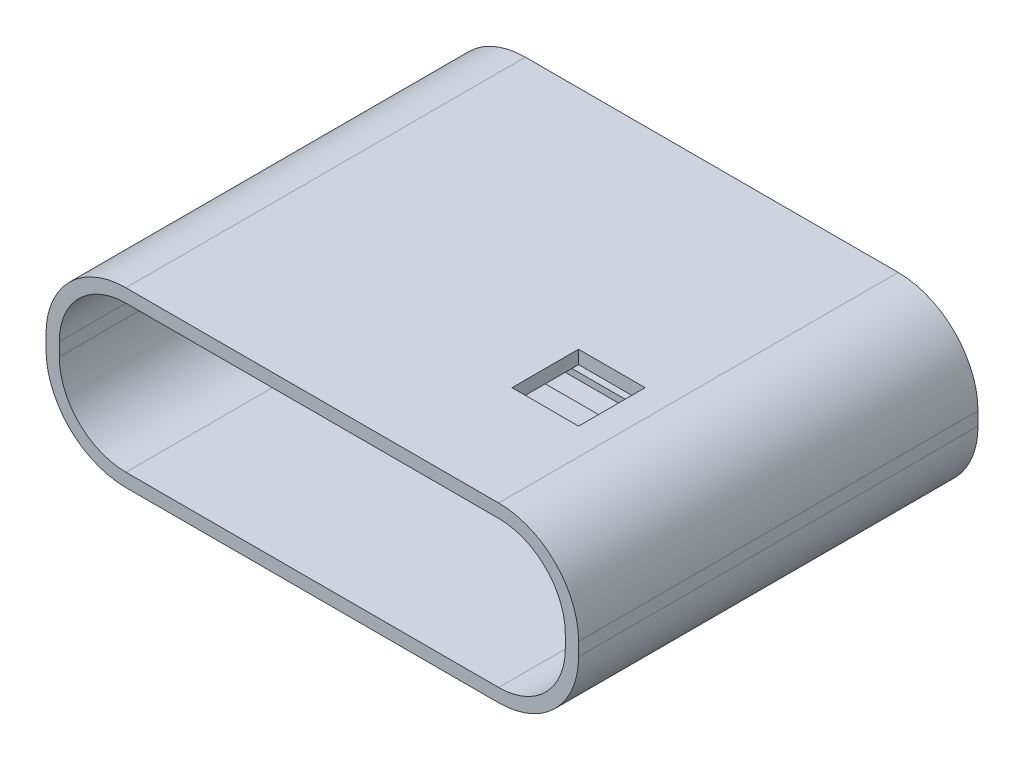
ISO-10303-21;
HEADER;
FILE_DESCRIPTION(('STEP AP214'),'2;1');
FILE_NAME('part.step','',(''),(''),'','','');
FILE_SCHEMA(('AUTOMOTIVE_DESIGN { 1 0 10303 214 1 1 1 1 }'));
ENDSEC;
DATA;
#1=APPLICATION_CONTEXT('core data for automotive mechanical design processes');
#2=APPLICATION_PROTOCOL_DEFINITION('international standard','automotive_design',2000,#1);
#3=PRODUCT_CONTEXT('',#1,'mechanical');
#4=PRODUCT('Part','Part','',(#3));
#5=PRODUCT_RELATED_PRODUCT_CATEGORY('part','',(#4));
#6=PRODUCT_DEFINITION_FORMATION('','',#4);
#7=PRODUCT_DEFINITION_CONTEXT('part definition',#1,'design');
#8=PRODUCT_DEFINITION('design','',#6,#7);
#9=PRODUCT_DEFINITION_SHAPE('','',#8);
#10=(LENGTH_UNIT() NAMED_UNIT(*) SI_UNIT(.MILLI.,.METRE.));
#11=(NAMED_UNIT(*) PLANE_ANGLE_UNIT() SI_UNIT($,.RADIAN.));
#12=(NAMED_UNIT(*) SI_UNIT($,.STERADIAN.) SOLID_ANGLE_UNIT());
#13=UNCERTAINTY_MEASURE_WITH_UNIT(LENGTH_MEASURE(1.E-05),#10,'distance_accuracy_value','');
#14=(GEOMETRIC_REPRESENTATION_CONTEXT(3) GLOBAL_UNCERTAINTY_ASSIGNED_CONTEXT((#13)) GLOBAL_UNIT_ASSIGNED_CONTEXT((#10,
#11,#12)) REPRESENTATION_CONTEXT('',''));
#15=CARTESIAN_POINT('',(0.,0.,0.));
#16=DIRECTION('',(0.,0.,1.));
#17=DIRECTION('',(1.,0.,0.));
#18=AXIS2_PLACEMENT_3D('',#15,#16,#17);
#19=CARTESIAN_POINT('',(-45.1180388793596,5.,30.));
#20=DIRECTION('',(0.,0.,-1.));
#21=DIRECTION('',(-1.,0.,0.));
#22=AXIS2_PLACEMENT_3D('',#19,#20,#21);
#23=PLANE('',#22);
#24=CARTESIAN_POINT('',(-45.1180388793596,5.,30.));
#25=DIRECTION('',(0.,0.,-1.));
#26=DIRECTION('',(-1.,0.,0.));
#27=AXIS2_PLACEMENT_3D('',#24,#25,#26);
#28=CIRCLE('',#27,6.);
#29=CARTESIAN_POINT('',(-51.1180388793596,4.99999999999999,30.));
#30=VERTEX_POINT('',#29);
#31=CARTESIAN_POINT('',(-45.1180388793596,-1.,30.));
#32=VERTEX_POINT('',#31);
#33=EDGE_CURVE('E370',#30,#32,#28,.F.);
#34=ORIENTED_EDGE('',*,*,#33,.T.);
#35=DIRECTION('',(1.,0.,0.));
#36=VECTOR('',#35,1.);
#37=CARTESIAN_POINT('',(-45.1180388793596,-1.,30.));
#38=LINE('',#37,#36);
#39=CARTESIAN_POINT('',(-17.1180388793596,-1.,30.));
#40=VERTEX_POINT('',#39);
#41=EDGE_CURVE('E373',#32,#40,#38,.T.);
#42=ORIENTED_EDGE('',*,*,#41,.T.);
#43=CARTESIAN_POINT('',(-17.1180388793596,5.,30.));
#44=DIRECTION('',(0.,0.,-1.));
#45=DIRECTION('',(-1.,0.,0.));
#46=AXIS2_PLACEMENT_3D('',#43,#44,#45);
#47=CIRCLE('',#46,6.);
#48=CARTESIAN_POINT('',(-11.1180388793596,5.,30.));
#49=VERTEX_POINT('',#48);
#50=EDGE_CURVE('E376',#40,#49,#47,.F.);
#51=ORIENTED_EDGE('',*,*,#50,.T.);
#52=DIRECTION('',(0.,1.,0.));
#53=VECTOR('',#52,1.);
#54=CARTESIAN_POINT('',(-11.1180388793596,5.,30.));
#55=LINE('',#54,#53);
#56=CARTESIAN_POINT('',(-11.1180388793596,6.,30.));
#57=VERTEX_POINT('',#56);
#58=EDGE_CURVE('E378',#49,#57,#55,.T.);
#59=ORIENTED_EDGE('',*,*,#58,.T.);
#60=CARTESIAN_POINT('',(-17.1180388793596,5.99999999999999,30.));
#61=DIRECTION('',(0.,0.,-1.));
#62=DIRECTION('',(-1.,0.,0.));
#63=AXIS2_PLACEMENT_3D('',#60,#61,#62);
#64=CIRCLE('',#63,6.);
#65=CARTESIAN_POINT('',(-17.1180388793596,12.,30.));
#66=VERTEX_POINT('',#65);
#67=EDGE_CURVE('E380',#57,#66,#64,.F.);
#68=ORIENTED_EDGE('',*,*,#67,.T.);
#69=DIRECTION('',(-1.,0.,0.));
#70=VECTOR('',#69,1.);
#71=CARTESIAN_POINT('',(-45.1180388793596,12.,30.));
#72=LINE('',#71,#70);
#73=CARTESIAN_POINT('',(-45.1180388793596,12.,30.));
#74=VERTEX_POINT('',#73);
#75=EDGE_CURVE('E382',#66,#74,#72,.T.);
#76=ORIENTED_EDGE('',*,*,#75,.T.);
#77=CARTESIAN_POINT('',(-45.1180388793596,5.99999999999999,30.));
#78=DIRECTION('',(0.,0.,-1.));
#79=DIRECTION('',(-1.,0.,0.));
#80=AXIS2_PLACEMENT_3D('',#77,#78,#79);
#81=CIRCLE('',#80,6.);
#82=CARTESIAN_POINT('',(-51.1180388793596,5.99999999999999,30.));
#83=VERTEX_POINT('',#82);
#84=EDGE_CURVE('E384',#74,#83,#81,.F.);
#85=ORIENTED_EDGE('',*,*,#84,.T.);
#86=DIRECTION('',(0.,-1.,0.));
#87=VECTOR('',#86,1.);
#88=CARTESIAN_POINT('',(-51.1180388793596,5.,30.));
#89=LINE('',#88,#87);
#90=EDGE_CURVE('E386',#83,#30,#89,.T.);
#91=ORIENTED_EDGE('',*,*,#90,.T.);
#92=EDGE_LOOP('',(#34,#42,#51,#59,#68,#76,#85,#91));
#93=FACE_BOUND('',#92,.T.);
#94=CARTESIAN_POINT('',(-45.1180388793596,5.,30.));
#95=DIRECTION('',(0.,0.,1.));
#96=DIRECTION('',(-1.,0.,0.));
#97=AXIS2_PLACEMENT_3D('',#94,#95,#96);
#98=CIRCLE('',#97,5.);
#99=CARTESIAN_POINT('',(-50.1180388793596,4.99999999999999,30.));
#100=VERTEX_POINT('',#99);
#101=CARTESIAN_POINT('',(-45.1180388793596,0.,30.));
#102=VERTEX_POINT('',#101);
#103=EDGE_CURVE('E311',#100,#102,#98,.T.);
#104=ORIENTED_EDGE('',*,*,#103,.F.);
#105=DIRECTION('',(0.,-1.,0.));
#106=VECTOR('',#105,1.);
#107=CARTESIAN_POINT('',(-50.1180388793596,5.99999999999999,30.));
#108=LINE('',#107,#106);
#109=CARTESIAN_POINT('',(-50.1180388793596,5.99999999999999,30.));
#110=VERTEX_POINT('',#109);
#111=EDGE_CURVE('E327',#110,#100,#108,.T.);
#112=ORIENTED_EDGE('',*,*,#111,.F.);
#113=CARTESIAN_POINT('',(-45.1180388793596,5.99999999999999,30.));
#114=DIRECTION('',(0.,0.,1.));
#115=DIRECTION('',(-1.,0.,0.));
#116=AXIS2_PLACEMENT_3D('',#113,#114,#115);
#117=CIRCLE('',#116,5.);
#118=CARTESIAN_POINT('',(-45.1180388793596,11.,30.));
#119=VERTEX_POINT('',#118);
#120=EDGE_CURVE('E324',#119,#110,#117,.T.);
#121=ORIENTED_EDGE('',*,*,#120,.F.);
#122=DIRECTION('',(-1.,0.,0.));
#123=VECTOR('',#122,1.);
#124=CARTESIAN_POINT('',(-17.1180388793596,11.,30.));
#125=LINE('',#124,#123);
#126=CARTESIAN_POINT('',(-17.1180388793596,11.,30.));
#127=VERTEX_POINT('',#126);
#128=EDGE_CURVE('E322',#127,#119,#125,.T.);
#129=ORIENTED_EDGE('',*,*,#128,.F.);
#130=CARTESIAN_POINT('',(-17.1180388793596,5.99999999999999,30.));
#131=DIRECTION('',(0.,0.,1.));
#132=DIRECTION('',(-1.,0.,0.));
#133=AXIS2_PLACEMENT_3D('',#130,#131,#132);
#134=CIRCLE('',#133,5.);
#135=CARTESIAN_POINT('',(-12.1180388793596,6.,30.));
#136=VERTEX_POINT('',#135);
#137=EDGE_CURVE('E320',#136,#127,#134,.T.);
#138=ORIENTED_EDGE('',*,*,#137,.F.);
#139=DIRECTION('',(0.,1.,0.));
#140=VECTOR('',#139,1.);
#141=CARTESIAN_POINT('',(-12.1180388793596,6.,30.));
#142=LINE('',#141,#140);
#143=CARTESIAN_POINT('',(-12.1180388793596,5.,30.));
#144=VERTEX_POINT('',#143);
#145=EDGE_CURVE('E318',#144,#136,#142,.T.);
#146=ORIENTED_EDGE('',*,*,#145,.F.);
#147=CARTESIAN_POINT('',(-17.1180388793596,5.,30.));
#148=DIRECTION('',(0.,0.,1.));
#149=DIRECTION('',(1.,0.,0.));
#150=AXIS2_PLACEMENT_3D('',#147,#148,#149);
#151=CIRCLE('',#150,5.);
#152=CARTESIAN_POINT('',(-17.1180388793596,0.,30.));
#153=VERTEX_POINT('',#152);
#154=EDGE_CURVE('E316',#153,#144,#151,.T.);
#155=ORIENTED_EDGE('',*,*,#154,.F.);
#156=DIRECTION('',(1.,0.,0.));
#157=VECTOR('',#156,1.);
#158=CARTESIAN_POINT('',(-45.1180388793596,0.,30.));
#159=LINE('',#158,#157);
#160=EDGE_CURVE('E313',#102,#153,#159,.T.);
#161=ORIENTED_EDGE('',*,*,#160,.F.);
#162=EDGE_LOOP('',(#104,#112,#121,#129,#138,#146,#155,#161));
#163=FACE_BOUND('',#162,.T.);
#164=ADVANCED_FACE('F81',(#93,#163),#23,.F.);
#165=CARTESIAN_POINT('',(-45.1180388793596,5.,0.));
#166=DIRECTION('',(0.,0.,-1.));
#167=DIRECTION('',(-1.,0.,0.));
#168=AXIS2_PLACEMENT_3D('',#165,#166,#167);
#169=PLANE('',#168);
#170=CARTESIAN_POINT('',(-45.1180388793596,5.,0.));
#171=DIRECTION('',(0.,0.,-1.));
#172=DIRECTION('',(-1.,0.,0.));
#173=AXIS2_PLACEMENT_3D('',#170,#171,#172);
#174=CIRCLE('',#173,6.);
#175=CARTESIAN_POINT('',(-51.1180388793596,4.99999999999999,0.));
#176=VERTEX_POINT('',#175);
#177=CARTESIAN_POINT('',(-45.1180388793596,-1.,0.));
#178=VERTEX_POINT('',#177);
#179=EDGE_CURVE('E369',#176,#178,#174,.F.);
#180=ORIENTED_EDGE('',*,*,#179,.F.);
#181=DIRECTION('',(0.,-1.,0.));
#182=VECTOR('',#181,1.);
#183=CARTESIAN_POINT('',(-51.1180388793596,5.,0.));
#184=LINE('',#183,#182);
#185=CARTESIAN_POINT('',(-51.1180388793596,5.99999999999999,0.));
#186=VERTEX_POINT('',#185);
#187=EDGE_CURVE('E374',#186,#176,#184,.T.);
#188=ORIENTED_EDGE('',*,*,#187,.F.);
#189=CARTESIAN_POINT('',(-45.1180388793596,5.99999999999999,0.));
#190=DIRECTION('',(0.,0.,-1.));
#191=DIRECTION('',(-1.,0.,0.));
#192=AXIS2_PLACEMENT_3D('',#189,#190,#191);
#193=CIRCLE('',#192,6.);
#194=CARTESIAN_POINT('',(-45.1180388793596,12.,0.));
#195=VERTEX_POINT('',#194);
#196=EDGE_CURVE('E401',#195,#186,#193,.F.);
#197=ORIENTED_EDGE('',*,*,#196,.F.);
#198=DIRECTION('',(-1.,0.,0.));
#199=VECTOR('',#198,1.);
#200=CARTESIAN_POINT('',(-45.1180388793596,12.,0.));
#201=LINE('',#200,#199);
#202=CARTESIAN_POINT('',(-17.1180388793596,12.,0.));
#203=VERTEX_POINT('',#202);
#204=EDGE_CURVE('E399',#203,#195,#201,.T.);
#205=ORIENTED_EDGE('',*,*,#204,.F.);
#206=CARTESIAN_POINT('',(-17.1180388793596,5.99999999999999,0.));
#207=DIRECTION('',(0.,0.,-1.));
#208=DIRECTION('',(-1.,0.,0.));
#209=AXIS2_PLACEMENT_3D('',#206,#207,#208);
#210=CIRCLE('',#209,6.);
#211=CARTESIAN_POINT('',(-11.1180388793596,6.,0.));
#212=VERTEX_POINT('',#211);
#213=EDGE_CURVE('E397',#212,#203,#210,.F.);
#214=ORIENTED_EDGE('',*,*,#213,.F.);
#215=DIRECTION('',(0.,1.,0.));
#216=VECTOR('',#215,1.);
#217=CARTESIAN_POINT('',(-11.1180388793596,5.,0.));
#218=LINE('',#217,#216);
#219=CARTESIAN_POINT('',(-11.1180388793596,5.,0.));
#220=VERTEX_POINT('',#219);
#221=EDGE_CURVE('E395',#220,#212,#218,.T.);
#222=ORIENTED_EDGE('',*,*,#221,.F.);
#223=CARTESIAN_POINT('',(-17.1180388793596,5.,0.));
#224=DIRECTION('',(0.,0.,-1.));
#225=DIRECTION('',(-1.,0.,0.));
#226=AXIS2_PLACEMENT_3D('',#223,#224,#225);
#227=CIRCLE('',#226,6.);
#228=CARTESIAN_POINT('',(-17.1180388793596,-1.,0.));
#229=VERTEX_POINT('',#228);
#230=EDGE_CURVE('E393',#229,#220,#227,.F.);
#231=ORIENTED_EDGE('',*,*,#230,.F.);
#232=DIRECTION('',(1.,0.,0.));
#233=VECTOR('',#232,1.);
#234=CARTESIAN_POINT('',(-45.1180388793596,-1.,0.));
#235=LINE('',#234,#233);
#236=EDGE_CURVE('E391',#178,#229,#235,.T.);
#237=ORIENTED_EDGE('',*,*,#236,.F.);
#238=EDGE_LOOP('',(#180,#188,#197,#205,#214,#222,#231,#237));
#239=FACE_BOUND('',#238,.T.);
#240=DIRECTION('',(0.,-1.,0.));
#241=VECTOR('',#240,1.);
#242=CARTESIAN_POINT('',(-50.1180388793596,5.99999999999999,0.));
#243=LINE('',#242,#241);
#244=CARTESIAN_POINT('',(-50.1180388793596,5.99999999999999,0.));
#245=VERTEX_POINT('',#244);
#246=CARTESIAN_POINT('',(-50.1180388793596,4.99999999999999,0.));
#247=VERTEX_POINT('',#246);
#248=EDGE_CURVE('E314',#245,#247,#243,.T.);
#249=ORIENTED_EDGE('',*,*,#248,.T.);
#250=CARTESIAN_POINT('',(-45.1180388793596,5.,0.));
#251=DIRECTION('',(0.,0.,1.));
#252=DIRECTION('',(-1.,0.,0.));
#253=AXIS2_PLACEMENT_3D('',#250,#251,#252);
#254=CIRCLE('',#253,5.);
#255=CARTESIAN_POINT('',(-45.1180388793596,0.,0.));
#256=VERTEX_POINT('',#255);
#257=EDGE_CURVE('E305',#247,#256,#254,.T.);
#258=ORIENTED_EDGE('',*,*,#257,.T.);
#259=DIRECTION('',(1.,0.,0.));
#260=VECTOR('',#259,1.);
#261=CARTESIAN_POINT('',(-45.1180388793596,0.,0.));
#262=LINE('',#261,#260);
#263=CARTESIAN_POINT('',(-17.1180388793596,0.,0.));
#264=VERTEX_POINT('',#263);
#265=EDGE_CURVE('E332',#256,#264,#262,.T.);
#266=ORIENTED_EDGE('',*,*,#265,.T.);
#267=CARTESIAN_POINT('',(-17.1180388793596,5.,0.));
#268=DIRECTION('',(0.,0.,1.));
#269=DIRECTION('',(1.,0.,0.));
#270=AXIS2_PLACEMENT_3D('',#267,#268,#269);
#271=CIRCLE('',#270,5.);
#272=CARTESIAN_POINT('',(-12.1180388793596,5.,0.));
#273=VERTEX_POINT('',#272);
#274=EDGE_CURVE('E335',#264,#273,#271,.T.);
#275=ORIENTED_EDGE('',*,*,#274,.T.);
#276=DIRECTION('',(0.,1.,0.));
#277=VECTOR('',#276,1.);
#278=CARTESIAN_POINT('',(-12.1180388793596,6.,0.));
#279=LINE('',#278,#277);
#280=CARTESIAN_POINT('',(-12.1180388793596,6.,0.));
#281=VERTEX_POINT('',#280);
#282=EDGE_CURVE('E338',#273,#281,#279,.T.);
#283=ORIENTED_EDGE('',*,*,#282,.T.);
#284=CARTESIAN_POINT('',(-17.1180388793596,5.99999999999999,0.));
#285=DIRECTION('',(0.,0.,1.));
#286=DIRECTION('',(-1.,0.,0.));
#287=AXIS2_PLACEMENT_3D('',#284,#285,#286);
#288=CIRCLE('',#287,5.);
#289=CARTESIAN_POINT('',(-17.1180388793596,11.,0.));
#290=VERTEX_POINT('',#289);
#291=EDGE_CURVE('E341',#281,#290,#288,.T.);
#292=ORIENTED_EDGE('',*,*,#291,.T.);
#293=DIRECTION('',(-1.,0.,0.));
#294=VECTOR('',#293,1.);
#295=CARTESIAN_POINT('',(-17.1180388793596,11.,0.));
#296=LINE('',#295,#294);
#297=CARTESIAN_POINT('',(-45.1180388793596,11.,0.));
#298=VERTEX_POINT('',#297);
#299=EDGE_CURVE('E344',#290,#298,#296,.T.);
#300=ORIENTED_EDGE('',*,*,#299,.T.);
#301=CARTESIAN_POINT('',(-45.1180388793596,5.99999999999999,0.));
#302=DIRECTION('',(0.,0.,1.));
#303=DIRECTION('',(-1.,0.,0.));
#304=AXIS2_PLACEMENT_3D('',#301,#302,#303);
#305=CIRCLE('',#304,5.);
#306=EDGE_CURVE('E347',#298,#245,#305,.T.);
#307=ORIENTED_EDGE('',*,*,#306,.T.);
#308=EDGE_LOOP('',(#249,#258,#266,#275,#283,#292,#300,#307));
#309=FACE_BOUND('',#308,.T.);
#310=ADVANCED_FACE('F431',(#239,#309),#169,.T.);
#311=CARTESIAN_POINT('',(-45.1180388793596,5.,30.));
#312=DIRECTION('',(0.,0.,-1.));
#313=DIRECTION('',(-1.,0.,0.));
#314=AXIS2_PLACEMENT_3D('',#311,#312,#313);
#315=CYLINDRICAL_SURFACE('',#314,6.);
#316=ORIENTED_EDGE('',*,*,#179,.T.);
#317=DIRECTION('',(0.,0.,-1.));
#318=VECTOR('',#317,1.);
#319=CARTESIAN_POINT('',(-45.1180388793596,-1.,30.));
#320=LINE('',#319,#318);
#321=EDGE_CURVE('E12',#32,#178,#320,.T.);
#322=ORIENTED_EDGE('',*,*,#321,.F.);
#323=ORIENTED_EDGE('',*,*,#33,.F.);
#324=DIRECTION('',(0.,0.,-1.));
#325=VECTOR('',#324,1.);
#326=CARTESIAN_POINT('',(-51.1180388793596,4.99999999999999,30.));
#327=LINE('',#326,#325);
#328=EDGE_CURVE('E388',#30,#176,#327,.T.);
#329=ORIENTED_EDGE('',*,*,#328,.T.);
#330=EDGE_LOOP('',(#316,#322,#323,#329));
#331=FACE_BOUND('',#330,.T.);
#332=ADVANCED_FACE('F83',(#331),#315,.T.);
#333=CARTESIAN_POINT('',(-45.1180388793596,-1.,30.));
#334=DIRECTION('',(0.,1.,0.));
#335=DIRECTION('',(0.,0.,1.));
#336=AXIS2_PLACEMENT_3D('',#333,#334,#335);
#337=PLANE('',#336);
#338=ORIENTED_EDGE('',*,*,#236,.T.);
#339=DIRECTION('',(0.,0.,-1.));
#340=VECTOR('',#339,1.);
#341=CARTESIAN_POINT('',(-17.1180388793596,-1.,30.));
#342=LINE('',#341,#340);
#343=EDGE_CURVE('E89',#40,#229,#342,.T.);
#344=ORIENTED_EDGE('',*,*,#343,.F.);
#345=ORIENTED_EDGE('',*,*,#41,.F.);
#346=ORIENTED_EDGE('',*,*,#321,.T.);
#347=EDGE_LOOP('',(#338,#344,#345,#346));
#348=FACE_BOUND('',#347,.T.);
#349=ADVANCED_FACE('F449',(#348),#337,.F.);
#350=CARTESIAN_POINT('',(-17.1180388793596,5.,30.));
#351=DIRECTION('',(0.,0.,-1.));
#352=DIRECTION('',(-1.,0.,0.));
#353=AXIS2_PLACEMENT_3D('',#350,#351,#352);
#354=CYLINDRICAL_SURFACE('',#353,6.);
#355=ORIENTED_EDGE('',*,*,#230,.T.);
#356=DIRECTION('',(0.,0.,-1.));
#357=VECTOR('',#356,1.);
#358=CARTESIAN_POINT('',(-11.1180388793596,5.,30.));
#359=LINE('',#358,#357);
#360=EDGE_CURVE('E418',#49,#220,#359,.T.);
#361=ORIENTED_EDGE('',*,*,#360,.F.);
#362=ORIENTED_EDGE('',*,*,#50,.F.);
#363=ORIENTED_EDGE('',*,*,#343,.T.);
#364=EDGE_LOOP('',(#355,#361,#362,#363));
#365=FACE_BOUND('',#364,.T.);
#366=ADVANCED_FACE('F425',(#365),#354,.T.);
#367=CARTESIAN_POINT('',(-11.1180388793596,5.,30.));
#368=DIRECTION('',(-1.,0.,0.));
#369=DIRECTION('',(0.,0.,1.));
#370=AXIS2_PLACEMENT_3D('',#367,#368,#369);
#371=PLANE('',#370);
#372=ORIENTED_EDGE('',*,*,#221,.T.);
#373=DIRECTION('',(0.,0.,-1.));
#374=VECTOR('',#373,1.);
#375=CARTESIAN_POINT('',(-11.1180388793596,6.,30.));
#376=LINE('',#375,#374);
#377=EDGE_CURVE('E415',#57,#212,#376,.T.);
#378=ORIENTED_EDGE('',*,*,#377,.F.);
#379=ORIENTED_EDGE('',*,*,#58,.F.);
#380=ORIENTED_EDGE('',*,*,#360,.T.);
#381=EDGE_LOOP('',(#372,#378,#379,#380));
#382=FACE_BOUND('',#381,.T.);
#383=ADVANCED_FACE('F437',(#382),#371,.F.);
#384=CARTESIAN_POINT('',(-17.1180388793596,5.99999999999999,30.));
#385=DIRECTION('',(0.,0.,-1.));
#386=DIRECTION('',(-1.,0.,0.));
#387=AXIS2_PLACEMENT_3D('',#384,#385,#386);
#388=CYLINDRICAL_SURFACE('',#387,6.);
#389=ORIENTED_EDGE('',*,*,#213,.T.);
#390=DIRECTION('',(0.,0.,-1.));
#391=VECTOR('',#390,1.);
#392=CARTESIAN_POINT('',(-17.1180388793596,12.,30.));
#393=LINE('',#392,#391);
#394=EDGE_CURVE('E412',#66,#203,#393,.T.);
#395=ORIENTED_EDGE('',*,*,#394,.F.);
#396=ORIENTED_EDGE('',*,*,#67,.F.);
#397=ORIENTED_EDGE('',*,*,#377,.T.);
#398=EDGE_LOOP('',(#389,#395,#396,#397));
#399=FACE_BOUND('',#398,.T.);
#400=ADVANCED_FACE('F441',(#399),#388,.T.);
#401=CARTESIAN_POINT('',(-45.1180388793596,12.,30.));
#402=DIRECTION('',(0.,-1.,0.));
#403=DIRECTION('',(1.,0.,0.));
#404=AXIS2_PLACEMENT_3D('',#401,#402,#403);
#405=PLANE('',#404);
#406=DIRECTION('',(1.,0.,0.));
#407=VECTOR('',#406,1.);
#408=CARTESIAN_POINT('',(-19.1180388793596,12.,22.));
#409=LINE('',#408,#407);
#410=CARTESIAN_POINT('',(-24.1180388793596,12.,22.));
#411=VERTEX_POINT('',#410);
#412=CARTESIAN_POINT('',(-19.1180388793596,12.,22.));
#413=VERTEX_POINT('',#412);
#414=EDGE_CURVE('E295',#411,#413,#409,.T.);
#415=ORIENTED_EDGE('',*,*,#414,.F.);
#416=DIRECTION('',(0.,0.,1.));
#417=VECTOR('',#416,1.);
#418=CARTESIAN_POINT('',(-24.1180388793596,12.,22.));
#419=LINE('',#418,#417);
#420=CARTESIAN_POINT('',(-24.1180388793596,12.,17.));
#421=VERTEX_POINT('',#420);
#422=EDGE_CURVE('E104',#421,#411,#419,.T.);
#423=ORIENTED_EDGE('',*,*,#422,.F.);
#424=DIRECTION('',(-1.,0.,0.));
#425=VECTOR('',#424,1.);
#426=CARTESIAN_POINT('',(-24.1180388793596,12.,17.));
#427=LINE('',#426,#425);
#428=CARTESIAN_POINT('',(-19.1180388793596,12.,17.));
#429=VERTEX_POINT('',#428);
#430=EDGE_CURVE('E284',#429,#421,#427,.T.);
#431=ORIENTED_EDGE('',*,*,#430,.F.);
#432=DIRECTION('',(0.,0.,-1.));
#433=VECTOR('',#432,1.);
#434=CARTESIAN_POINT('',(-19.1180388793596,12.,17.));
#435=LINE('',#434,#433);
#436=EDGE_CURVE('E298',#413,#429,#435,.T.);
#437=ORIENTED_EDGE('',*,*,#436,.F.);
#438=EDGE_LOOP('',(#415,#423,#431,#437));
#439=FACE_BOUND('',#438,.T.);
#440=ORIENTED_EDGE('',*,*,#204,.T.);
#441=DIRECTION('',(0.,0.,-1.));
#442=VECTOR('',#441,1.);
#443=CARTESIAN_POINT('',(-45.1180388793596,12.,30.));
#444=LINE('',#443,#442);
#445=EDGE_CURVE('E409',#74,#195,#444,.T.);
#446=ORIENTED_EDGE('',*,*,#445,.F.);
#447=ORIENTED_EDGE('',*,*,#75,.F.);
#448=ORIENTED_EDGE('',*,*,#394,.T.);
#449=EDGE_LOOP('',(#440,#446,#447,#448));
#450=FACE_BOUND('',#449,.T.);
#451=ADVANCED_FACE('F462',(#439,#450),#405,.F.);
#452=CARTESIAN_POINT('',(-45.1180388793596,5.99999999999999,30.));
#453=DIRECTION('',(0.,0.,-1.));
#454=DIRECTION('',(-1.,0.,0.));
#455=AXIS2_PLACEMENT_3D('',#452,#453,#454);
#456=CYLINDRICAL_SURFACE('',#455,6.);
#457=ORIENTED_EDGE('',*,*,#196,.T.);
#458=DIRECTION('',(0.,0.,-1.));
#459=VECTOR('',#458,1.);
#460=CARTESIAN_POINT('',(-51.1180388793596,5.99999999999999,30.));
#461=LINE('',#460,#459);
#462=EDGE_CURVE('E406',#83,#186,#461,.T.);
#463=ORIENTED_EDGE('',*,*,#462,.F.);
#464=ORIENTED_EDGE('',*,*,#84,.F.);
#465=ORIENTED_EDGE('',*,*,#445,.T.);
#466=EDGE_LOOP('',(#457,#463,#464,#465));
#467=FACE_BOUND('',#466,.T.);
#468=ADVANCED_FACE('F460',(#467),#456,.T.);
#469=CARTESIAN_POINT('',(-51.1180388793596,5.,30.));
#470=DIRECTION('',(1.,0.,0.));
#471=DIRECTION('',(0.,0.,-1.));
#472=AXIS2_PLACEMENT_3D('',#469,#470,#471);
#473=PLANE('',#472);
#474=ORIENTED_EDGE('',*,*,#187,.T.);
#475=ORIENTED_EDGE('',*,*,#328,.F.);
#476=ORIENTED_EDGE('',*,*,#90,.F.);
#477=ORIENTED_EDGE('',*,*,#462,.T.);
#478=EDGE_LOOP('',(#474,#475,#476,#477));
#479=FACE_BOUND('',#478,.T.);
#480=ADVANCED_FACE('F455',(#479),#473,.F.);
#481=CARTESIAN_POINT('',(-45.1180388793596,5.,30.));
#482=DIRECTION('',(0.,0.,-1.));
#483=DIRECTION('',(-1.,0.,0.));
#484=AXIS2_PLACEMENT_3D('',#481,#482,#483);
#485=CYLINDRICAL_SURFACE('',#484,5.);
#486=ORIENTED_EDGE('',*,*,#257,.F.);
#487=DIRECTION('',(0.,0.,-1.));
#488=VECTOR('',#487,1.);
#489=CARTESIAN_POINT('',(-50.1180388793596,4.99999999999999,30.));
#490=LINE('',#489,#488);
#491=EDGE_CURVE('E329',#100,#247,#490,.T.);
#492=ORIENTED_EDGE('',*,*,#491,.F.);
#493=ORIENTED_EDGE('',*,*,#103,.T.);
#494=DIRECTION('',(0.,0.,-1.));
#495=VECTOR('',#494,1.);
#496=CARTESIAN_POINT('',(-45.1180388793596,0.,30.));
#497=LINE('',#496,#495);
#498=EDGE_CURVE('E366',#102,#256,#497,.T.);
#499=ORIENTED_EDGE('',*,*,#498,.T.);
#500=EDGE_LOOP('',(#486,#492,#493,#499));
#501=FACE_BOUND('',#500,.T.);
#502=ADVANCED_FACE('F480',(#501),#485,.F.);
#503=CARTESIAN_POINT('',(-45.1180388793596,0.,30.));
#504=DIRECTION('',(0.,1.,0.));
#505=DIRECTION('',(0.,0.,1.));
#506=AXIS2_PLACEMENT_3D('',#503,#504,#505);
#507=PLANE('',#506);
#508=DIRECTION('',(0.,0.,-1.));
#509=VECTOR('',#508,1.);
#510=CARTESIAN_POINT('',(-25.1180388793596,0.,6.5));
#511=LINE('',#510,#509);
#512=CARTESIAN_POINT('',(-25.1180388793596,0.,8.5));
#513=VERTEX_POINT('',#512);
#514=CARTESIAN_POINT('',(-25.1180388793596,0.,6.5));
#515=VERTEX_POINT('',#514);
#516=EDGE_CURVE('E96',#513,#515,#511,.T.);
#517=ORIENTED_EDGE('',*,*,#516,.F.);
#518=DIRECTION('',(1.,0.,0.));
#519=VECTOR('',#518,1.);
#520=CARTESIAN_POINT('',(-25.1180388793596,0.,8.5));
#521=LINE('',#520,#519);
#522=CARTESIAN_POINT('',(-37.1180388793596,0.,8.5));
#523=VERTEX_POINT('',#522);
#524=EDGE_CURVE('E262',#523,#513,#521,.T.);
#525=ORIENTED_EDGE('',*,*,#524,.F.);
#526=DIRECTION('',(0.,0.,1.));
#527=VECTOR('',#526,1.);
#528=CARTESIAN_POINT('',(-37.1180388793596,0.,8.5));
#529=LINE('',#528,#527);
#530=CARTESIAN_POINT('',(-37.1180388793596,0.,6.5));
#531=VERTEX_POINT('',#530);
#532=EDGE_CURVE('E265',#531,#523,#529,.T.);
#533=ORIENTED_EDGE('',*,*,#532,.F.);
#534=DIRECTION('',(-1.,0.,0.));
#535=VECTOR('',#534,1.);
#536=CARTESIAN_POINT('',(-25.1180388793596,0.,6.5));
#537=LINE('',#536,#535);
#538=EDGE_CURVE('E271',#515,#531,#537,.T.);
#539=ORIENTED_EDGE('',*,*,#538,.F.);
#540=EDGE_LOOP('',(#517,#525,#533,#539));
#541=FACE_BOUND('',#540,.T.);
#542=ORIENTED_EDGE('',*,*,#265,.F.);
#543=ORIENTED_EDGE('',*,*,#498,.F.);
#544=ORIENTED_EDGE('',*,*,#160,.T.);
#545=DIRECTION('',(0.,0.,-1.));
#546=VECTOR('',#545,1.);
#547=CARTESIAN_POINT('',(-17.1180388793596,0.,30.));
#548=LINE('',#547,#546);
#549=EDGE_CURVE('E364',#153,#264,#548,.T.);
#550=ORIENTED_EDGE('',*,*,#549,.T.);
#551=EDGE_LOOP('',(#542,#543,#544,#550));
#552=FACE_BOUND('',#551,.T.);
#553=ADVANCED_FACE('F487',(#541,#552),#507,.T.);
#554=CARTESIAN_POINT('',(-17.1180388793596,5.,30.));
#555=DIRECTION('',(0.,0.,-1.));
#556=DIRECTION('',(-1.,0.,0.));
#557=AXIS2_PLACEMENT_3D('',#554,#555,#556);
#558=CYLINDRICAL_SURFACE('',#557,5.);
#559=ORIENTED_EDGE('',*,*,#274,.F.);
#560=ORIENTED_EDGE('',*,*,#549,.F.);
#561=ORIENTED_EDGE('',*,*,#154,.T.);
#562=DIRECTION('',(0.,0.,-1.));
#563=VECTOR('',#562,1.);
#564=CARTESIAN_POINT('',(-12.1180388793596,5.,30.));
#565=LINE('',#564,#563);
#566=EDGE_CURVE('E362',#144,#273,#565,.T.);
#567=ORIENTED_EDGE('',*,*,#566,.T.);
#568=EDGE_LOOP('',(#559,#560,#561,#567));
#569=FACE_BOUND('',#568,.T.);
#570=ADVANCED_FACE('F492',(#569),#558,.F.);
#571=CARTESIAN_POINT('',(-12.1180388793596,6.,30.));
#572=DIRECTION('',(-1.,0.,0.));
#573=DIRECTION('',(0.,0.,1.));
#574=AXIS2_PLACEMENT_3D('',#571,#572,#573);
#575=PLANE('',#574);
#576=ORIENTED_EDGE('',*,*,#282,.F.);
#577=ORIENTED_EDGE('',*,*,#566,.F.);
#578=ORIENTED_EDGE('',*,*,#145,.T.);
#579=DIRECTION('',(0.,0.,-1.));
#580=VECTOR('',#579,1.);
#581=CARTESIAN_POINT('',(-12.1180388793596,6.,30.));
#582=LINE('',#581,#580);
#583=EDGE_CURVE('E360',#136,#281,#582,.T.);
#584=ORIENTED_EDGE('',*,*,#583,.T.);
#585=EDGE_LOOP('',(#576,#577,#578,#584));
#586=FACE_BOUND('',#585,.T.);
#587=ADVANCED_FACE('F518',(#586),#575,.T.);
#588=CARTESIAN_POINT('',(-17.1180388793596,5.99999999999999,30.));
#589=DIRECTION('',(0.,0.,-1.));
#590=DIRECTION('',(-1.,0.,0.));
#591=AXIS2_PLACEMENT_3D('',#588,#589,#590);
#592=CYLINDRICAL_SURFACE('',#591,5.);
#593=ORIENTED_EDGE('',*,*,#291,.F.);
#594=ORIENTED_EDGE('',*,*,#583,.F.);
#595=ORIENTED_EDGE('',*,*,#137,.T.);
#596=DIRECTION('',(0.,0.,-1.));
#597=VECTOR('',#596,1.);
#598=CARTESIAN_POINT('',(-17.1180388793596,11.,30.));
#599=LINE('',#598,#597);
#600=EDGE_CURVE('E358',#127,#290,#599,.T.);
#601=ORIENTED_EDGE('',*,*,#600,.T.);
#602=EDGE_LOOP('',(#593,#594,#595,#601));
#603=FACE_BOUND('',#602,.T.);
#604=ADVANCED_FACE('F523',(#603),#592,.F.);
#605=CARTESIAN_POINT('',(-17.1180388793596,11.,30.));
#606=DIRECTION('',(0.,-1.,0.));
#607=DIRECTION('',(1.,0.,0.));
#608=AXIS2_PLACEMENT_3D('',#605,#606,#607);
#609=PLANE('',#608);
#610=DIRECTION('',(0.,0.,1.));
#611=VECTOR('',#610,1.);
#612=CARTESIAN_POINT('',(-24.1180388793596,11.,22.));
#613=LINE('',#612,#611);
#614=CARTESIAN_POINT('',(-24.1180388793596,11.,17.));
#615=VERTEX_POINT('',#614);
#616=CARTESIAN_POINT('',(-24.1180388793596,11.,22.));
#617=VERTEX_POINT('',#616);
#618=EDGE_CURVE('E280',#615,#617,#613,.T.);
#619=ORIENTED_EDGE('',*,*,#618,.T.);
#620=DIRECTION('',(1.,0.,0.));
#621=VECTOR('',#620,1.);
#622=CARTESIAN_POINT('',(-19.1180388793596,11.,22.));
#623=LINE('',#622,#621);
#624=CARTESIAN_POINT('',(-19.1180388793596,11.,22.));
#625=VERTEX_POINT('',#624);
#626=EDGE_CURVE('E283',#617,#625,#623,.T.);
#627=ORIENTED_EDGE('',*,*,#626,.T.);
#628=DIRECTION('',(0.,0.,-1.));
#629=VECTOR('',#628,1.);
#630=CARTESIAN_POINT('',(-19.1180388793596,11.,17.));
#631=LINE('',#630,#629);
#632=CARTESIAN_POINT('',(-19.1180388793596,11.,17.));
#633=VERTEX_POINT('',#632);
#634=EDGE_CURVE('E287',#625,#633,#631,.T.);
#635=ORIENTED_EDGE('',*,*,#634,.T.);
#636=DIRECTION('',(-1.,0.,0.));
#637=VECTOR('',#636,1.);
#638=CARTESIAN_POINT('',(-24.1180388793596,11.,17.));
#639=LINE('',#638,#637);
#640=EDGE_CURVE('E290',#633,#615,#639,.T.);
#641=ORIENTED_EDGE('',*,*,#640,.T.);
#642=EDGE_LOOP('',(#619,#627,#635,#641));
#643=FACE_BOUND('',#642,.T.);
#644=ORIENTED_EDGE('',*,*,#299,.F.);
#645=ORIENTED_EDGE('',*,*,#600,.F.);
#646=ORIENTED_EDGE('',*,*,#128,.T.);
#647=DIRECTION('',(0.,0.,-1.));
#648=VECTOR('',#647,1.);
#649=CARTESIAN_POINT('',(-45.1180388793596,11.,30.));
#650=LINE('',#649,#648);
#651=EDGE_CURVE('E356',#119,#298,#650,.T.);
#652=ORIENTED_EDGE('',*,*,#651,.T.);
#653=EDGE_LOOP('',(#644,#645,#646,#652));
#654=FACE_BOUND('',#653,.T.);
#655=ADVANCED_FACE('F526',(#643,#654),#609,.T.);
#656=CARTESIAN_POINT('',(-45.1180388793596,5.99999999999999,30.));
#657=DIRECTION('',(0.,0.,-1.));
#658=DIRECTION('',(-1.,0.,0.));
#659=AXIS2_PLACEMENT_3D('',#656,#657,#658);
#660=CYLINDRICAL_SURFACE('',#659,5.);
#661=ORIENTED_EDGE('',*,*,#306,.F.);
#662=ORIENTED_EDGE('',*,*,#651,.F.);
#663=ORIENTED_EDGE('',*,*,#120,.T.);
#664=DIRECTION('',(0.,0.,-1.));
#665=VECTOR('',#664,1.);
#666=CARTESIAN_POINT('',(-50.1180388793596,5.99999999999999,30.));
#667=LINE('',#666,#665);
#668=EDGE_CURVE('E354',#110,#245,#667,.T.);
#669=ORIENTED_EDGE('',*,*,#668,.T.);
#670=EDGE_LOOP('',(#661,#662,#663,#669));
#671=FACE_BOUND('',#670,.T.);
#672=ADVANCED_FACE('F505',(#671),#660,.F.);
#673=CARTESIAN_POINT('',(-50.1180388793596,5.99999999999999,30.));
#674=DIRECTION('',(1.,0.,0.));
#675=DIRECTION('',(0.,0.,-1.));
#676=AXIS2_PLACEMENT_3D('',#673,#674,#675);
#677=PLANE('',#676);
#678=ORIENTED_EDGE('',*,*,#248,.F.);
#679=ORIENTED_EDGE('',*,*,#668,.F.);
#680=ORIENTED_EDGE('',*,*,#111,.T.);
#681=ORIENTED_EDGE('',*,*,#491,.T.);
#682=EDGE_LOOP('',(#678,#679,#680,#681));
#683=FACE_BOUND('',#682,.T.);
#684=ADVANCED_FACE('F499',(#683),#677,.T.);
#685=CARTESIAN_POINT('',(-24.1180388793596,11.,22.));
#686=DIRECTION('',(-1.,0.,0.));
#687=DIRECTION('',(0.,-1.,0.));
#688=AXIS2_PLACEMENT_3D('',#685,#686,#687);
#689=PLANE('',#688);
#690=ORIENTED_EDGE('',*,*,#422,.T.);
#691=DIRECTION('',(0.,1.,0.));
#692=VECTOR('',#691,1.);
#693=CARTESIAN_POINT('',(-24.1180388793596,11.,22.));
#694=LINE('',#693,#692);
#695=EDGE_CURVE('E293',#617,#411,#694,.T.);
#696=ORIENTED_EDGE('',*,*,#695,.F.);
#697=ORIENTED_EDGE('',*,*,#618,.F.);
#698=DIRECTION('',(0.,1.,0.));
#699=VECTOR('',#698,1.);
#700=CARTESIAN_POINT('',(-24.1180388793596,11.,17.));
#701=LINE('',#700,#699);
#702=EDGE_CURVE('E303',#615,#421,#701,.T.);
#703=ORIENTED_EDGE('',*,*,#702,.T.);
#704=EDGE_LOOP('',(#690,#696,#697,#703));
#705=FACE_BOUND('',#704,.T.);
#706=ADVANCED_FACE('F568',(#705),#689,.F.);
#707=CARTESIAN_POINT('',(-24.1180388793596,11.,17.));
#708=DIRECTION('',(0.,0.,-1.));
#709=DIRECTION('',(-1.,0.,0.));
#710=AXIS2_PLACEMENT_3D('',#707,#708,#709);
#711=PLANE('',#710);
#712=ORIENTED_EDGE('',*,*,#430,.T.);
#713=ORIENTED_EDGE('',*,*,#702,.F.);
#714=ORIENTED_EDGE('',*,*,#640,.F.);
#715=DIRECTION('',(0.,1.,0.));
#716=VECTOR('',#715,1.);
#717=CARTESIAN_POINT('',(-19.1180388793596,11.,17.));
#718=LINE('',#717,#716);
#719=EDGE_CURVE('E306',#633,#429,#718,.T.);
#720=ORIENTED_EDGE('',*,*,#719,.T.);
#721=EDGE_LOOP('',(#712,#713,#714,#720));
#722=FACE_BOUND('',#721,.T.);
#723=ADVANCED_FACE('F586',(#722),#711,.F.);
#724=CARTESIAN_POINT('',(-19.1180388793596,11.,17.));
#725=DIRECTION('',(1.,0.,0.));
#726=DIRECTION('',(0.,0.,-1.));
#727=AXIS2_PLACEMENT_3D('',#724,#725,#726);
#728=PLANE('',#727);
#729=ORIENTED_EDGE('',*,*,#436,.T.);
#730=ORIENTED_EDGE('',*,*,#719,.F.);
#731=ORIENTED_EDGE('',*,*,#634,.F.);
#732=DIRECTION('',(0.,1.,0.));
#733=VECTOR('',#732,1.);
#734=CARTESIAN_POINT('',(-19.1180388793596,11.,22.));
#735=LINE('',#734,#733);
#736=EDGE_CURVE('E308',#625,#413,#735,.T.);
#737=ORIENTED_EDGE('',*,*,#736,.T.);
#738=EDGE_LOOP('',(#729,#730,#731,#737));
#739=FACE_BOUND('',#738,.T.);
#740=ADVANCED_FACE('F595',(#739),#728,.F.);
#741=CARTESIAN_POINT('',(-19.1180388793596,11.,22.));
#742=DIRECTION('',(0.,0.,1.));
#743=DIRECTION('',(1.,0.,0.));
#744=AXIS2_PLACEMENT_3D('',#741,#742,#743);
#745=PLANE('',#744);
#746=ORIENTED_EDGE('',*,*,#414,.T.);
#747=ORIENTED_EDGE('',*,*,#736,.F.);
#748=ORIENTED_EDGE('',*,*,#626,.F.);
#749=ORIENTED_EDGE('',*,*,#695,.T.);
#750=EDGE_LOOP('',(#746,#747,#748,#749));
#751=FACE_BOUND('',#750,.T.);
#752=ADVANCED_FACE('F605',(#751),#745,.F.);
#753=CARTESIAN_POINT('',(-25.1180388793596,-0.5,6.5));
#754=DIRECTION('',(1.,0.,0.));
#755=DIRECTION('',(0.,0.,-1.));
#756=AXIS2_PLACEMENT_3D('',#753,#754,#755);
#757=PLANE('',#756);
#758=ORIENTED_EDGE('',*,*,#516,.T.);
#759=DIRECTION('',(0.,1.,0.));
#760=VECTOR('',#759,1.);
#761=CARTESIAN_POINT('',(-25.1180388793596,-0.5,6.5));
#762=LINE('',#761,#760);
#763=CARTESIAN_POINT('',(-25.1180388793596,-0.5,6.5));
#764=VERTEX_POINT('',#763);
#765=EDGE_CURVE('E240',#764,#515,#762,.T.);
#766=ORIENTED_EDGE('',*,*,#765,.F.);
#767=DIRECTION('',(0.,0.,-1.));
#768=VECTOR('',#767,1.);
#769=CARTESIAN_POINT('',(-25.1180388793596,-0.5,6.5));
#770=LINE('',#769,#768);
#771=CARTESIAN_POINT('',(-25.1180388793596,-0.5,8.5));
#772=VERTEX_POINT('',#771);
#773=EDGE_CURVE('E244',#772,#764,#770,.T.);
#774=ORIENTED_EDGE('',*,*,#773,.F.);
#775=DIRECTION('',(0.,1.,0.));
#776=VECTOR('',#775,1.);
#777=CARTESIAN_POINT('',(-25.1180388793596,-0.5,8.5));
#778=LINE('',#777,#776);
#779=EDGE_CURVE('E275',#772,#513,#778,.T.);
#780=ORIENTED_EDGE('',*,*,#779,.T.);
#781=EDGE_LOOP('',(#758,#766,#774,#780));
#782=FACE_BOUND('',#781,.T.);
#783=ADVANCED_FACE('F242',(#782),#757,.F.);
#784=CARTESIAN_POINT('',(-25.1180388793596,-0.5,8.5));
#785=DIRECTION('',(0.,0.,1.));
#786=DIRECTION('',(1.,0.,0.));
#787=AXIS2_PLACEMENT_3D('',#784,#785,#786);
#788=PLANE('',#787);
#789=ORIENTED_EDGE('',*,*,#524,.T.);
#790=ORIENTED_EDGE('',*,*,#779,.F.);
#791=DIRECTION('',(1.,0.,0.));
#792=VECTOR('',#791,1.);
#793=CARTESIAN_POINT('',(-25.1180388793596,-0.5,8.5));
#794=LINE('',#793,#792);
#795=CARTESIAN_POINT('',(-37.1180388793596,-0.5,8.5));
#796=VERTEX_POINT('',#795);
#797=EDGE_CURVE('E250',#796,#772,#794,.T.);
#798=ORIENTED_EDGE('',*,*,#797,.F.);
#799=DIRECTION('',(0.,1.,0.));
#800=VECTOR('',#799,1.);
#801=CARTESIAN_POINT('',(-37.1180388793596,-0.5,8.5));
#802=LINE('',#801,#800);
#803=EDGE_CURVE('E277',#796,#523,#802,.T.);
#804=ORIENTED_EDGE('',*,*,#803,.T.);
#805=EDGE_LOOP('',(#789,#790,#798,#804));
#806=FACE_BOUND('',#805,.T.);
#807=ADVANCED_FACE('F629',(#806),#788,.F.);
#808=CARTESIAN_POINT('',(-37.1180388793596,-0.5,8.5));
#809=DIRECTION('',(-1.,0.,0.));
#810=DIRECTION('',(0.,0.,1.));
#811=AXIS2_PLACEMENT_3D('',#808,#809,#810);
#812=PLANE('',#811);
#813=ORIENTED_EDGE('',*,*,#532,.T.);
#814=ORIENTED_EDGE('',*,*,#803,.F.);
#815=DIRECTION('',(0.,0.,1.));
#816=VECTOR('',#815,1.);
#817=CARTESIAN_POINT('',(-37.1180388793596,-0.5,8.5));
#818=LINE('',#817,#816);
#819=CARTESIAN_POINT('',(-37.1180388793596,-0.5,6.5));
#820=VERTEX_POINT('',#819);
#821=EDGE_CURVE('E258',#820,#796,#818,.T.);
#822=ORIENTED_EDGE('',*,*,#821,.F.);
#823=DIRECTION('',(0.,1.,0.));
#824=VECTOR('',#823,1.);
#825=CARTESIAN_POINT('',(-37.1180388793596,-0.5,6.5));
#826=LINE('',#825,#824);
#827=EDGE_CURVE('E249',#820,#531,#826,.T.);
#828=ORIENTED_EDGE('',*,*,#827,.T.);
#829=EDGE_LOOP('',(#813,#814,#822,#828));
#830=FACE_BOUND('',#829,.T.);
#831=ADVANCED_FACE('F638',(#830),#812,.F.);
#832=CARTESIAN_POINT('',(-25.1180388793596,-0.5,6.5));
#833=DIRECTION('',(0.,0.,-1.));
#834=DIRECTION('',(-1.,0.,0.));
#835=AXIS2_PLACEMENT_3D('',#832,#833,#834);
#836=PLANE('',#835);
#837=ORIENTED_EDGE('',*,*,#538,.T.);
#838=ORIENTED_EDGE('',*,*,#827,.F.);
#839=DIRECTION('',(-1.,0.,0.));
#840=VECTOR('',#839,1.);
#841=CARTESIAN_POINT('',(-25.1180388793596,-0.5,6.5));
#842=LINE('',#841,#840);
#843=EDGE_CURVE('E253',#764,#820,#842,.T.);
#844=ORIENTED_EDGE('',*,*,#843,.F.);
#845=ORIENTED_EDGE('',*,*,#765,.T.);
#846=EDGE_LOOP('',(#837,#838,#844,#845));
#847=FACE_BOUND('',#846,.T.);
#848=ADVANCED_FACE('F254',(#847),#836,.F.);
#849=CARTESIAN_POINT('',(0.,-0.5,0.));
#850=DIRECTION('',(0.,-1.,0.));
#851=DIRECTION('',(0.,0.,-1.));
#852=AXIS2_PLACEMENT_3D('',#849,#850,#851);
#853=PLANE('',#852);
#854=ORIENTED_EDGE('',*,*,#773,.T.);
#855=ORIENTED_EDGE('',*,*,#843,.T.);
#856=ORIENTED_EDGE('',*,*,#821,.T.);
#857=ORIENTED_EDGE('',*,*,#797,.T.);
#858=EDGE_LOOP('',(#854,#855,#856,#857));
#859=FACE_BOUND('',#858,.T.);
#860=ADVANCED_FACE('F260',(#859),#853,.F.);
#861=CLOSED_SHELL('',(#164,#310,#332,#349,#366,#383,#400,#451,#468,#480,#502,#553,#570,#587,
#604,#655,#672,#684,#706,#723,#740,#752,#783,#807,#831,#848,#860));
#862=MANIFOLD_SOLID_BREP('B2',#861);
#863=ADVANCED_BREP_SHAPE_REPRESENTATION('',(#18,#862),#14);
#864=SHAPE_DEFINITION_REPRESENTATION(#9,#863);
ENDSEC;
END-ISO-10303-21;
